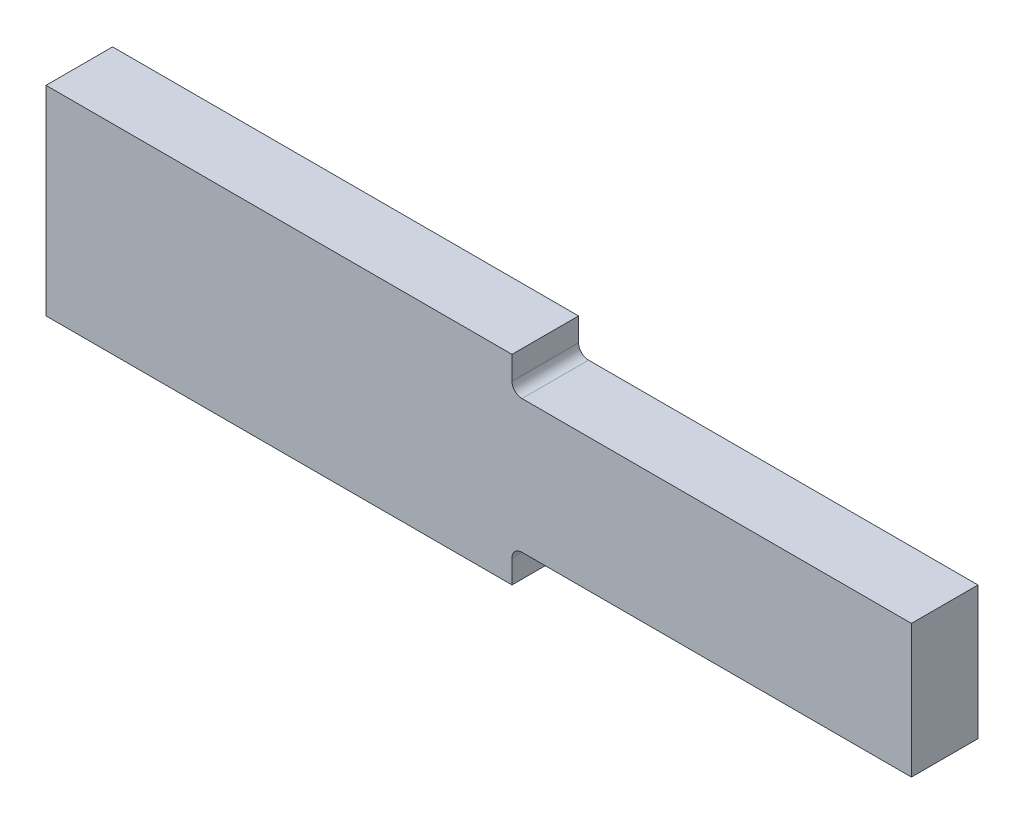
ISO-10303-21;
HEADER;
FILE_DESCRIPTION(('STEP AP214'),'2;1');
FILE_NAME('part.step','',(''),(''),'','','');
FILE_SCHEMA(('AUTOMOTIVE_DESIGN { 1 0 10303 214 1 1 1 1 }'));
ENDSEC;
DATA;
#1=APPLICATION_CONTEXT('core data for automotive mechanical design processes');
#2=APPLICATION_PROTOCOL_DEFINITION('international standard','automotive_design',2000,#1);
#3=PRODUCT_CONTEXT('',#1,'mechanical');
#4=PRODUCT('Part','Part','',(#3));
#5=PRODUCT_RELATED_PRODUCT_CATEGORY('part','',(#4));
#6=PRODUCT_DEFINITION_FORMATION('','',#4);
#7=PRODUCT_DEFINITION_CONTEXT('part definition',#1,'design');
#8=PRODUCT_DEFINITION('design','',#6,#7);
#9=PRODUCT_DEFINITION_SHAPE('','',#8);
#10=(LENGTH_UNIT() NAMED_UNIT(*) SI_UNIT(.MILLI.,.METRE.));
#11=(NAMED_UNIT(*) PLANE_ANGLE_UNIT() SI_UNIT($,.RADIAN.));
#12=(NAMED_UNIT(*) SI_UNIT($,.STERADIAN.) SOLID_ANGLE_UNIT());
#13=UNCERTAINTY_MEASURE_WITH_UNIT(LENGTH_MEASURE(1.E-05),#10,'distance_accuracy_value','');
#14=(GEOMETRIC_REPRESENTATION_CONTEXT(3) GLOBAL_UNCERTAINTY_ASSIGNED_CONTEXT((#13)) GLOBAL_UNIT_ASSIGNED_CONTEXT((#10,
#11,#12)) REPRESENTATION_CONTEXT('',''));
#15=CARTESIAN_POINT('',(0.,0.,0.));
#16=DIRECTION('',(0.,0.,1.));
#17=DIRECTION('',(1.,0.,0.));
#18=AXIS2_PLACEMENT_3D('',#15,#16,#17);
#19=CARTESIAN_POINT('',(140.,-30.,20.));
#20=DIRECTION('',(0.,1.,0.));
#21=DIRECTION('',(0.,0.,1.));
#22=AXIS2_PLACEMENT_3D('',#19,#20,#21);
#23=PLANE('',#22);
#24=DIRECTION('',(1.,0.,0.));
#25=VECTOR('',#24,1.);
#26=CARTESIAN_POINT('',(140.,-30.,0.));
#27=LINE('',#26,#25);
#28=CARTESIAN_POINT('',(0.,-30.,0.));
#29=VERTEX_POINT('',#28);
#30=CARTESIAN_POINT('',(140.,-30.,0.));
#31=VERTEX_POINT('',#30);
#32=EDGE_CURVE('E133',#29,#31,#27,.T.);
#33=ORIENTED_EDGE('',*,*,#32,.T.);
#34=DIRECTION('',(0.,0.,-1.));
#35=VECTOR('',#34,1.);
#36=CARTESIAN_POINT('',(140.,-30.,20.));
#37=LINE('',#36,#35);
#38=CARTESIAN_POINT('',(140.,-30.,20.));
#39=VERTEX_POINT('',#38);
#40=EDGE_CURVE('E114',#39,#31,#37,.T.);
#41=ORIENTED_EDGE('',*,*,#40,.F.);
#42=DIRECTION('',(1.,0.,0.));
#43=VECTOR('',#42,1.);
#44=CARTESIAN_POINT('',(140.,-30.,20.));
#45=LINE('',#44,#43);
#46=CARTESIAN_POINT('',(0.,-30.,20.));
#47=VERTEX_POINT('',#46);
#48=EDGE_CURVE('E121',#47,#39,#45,.T.);
#49=ORIENTED_EDGE('',*,*,#48,.F.);
#50=DIRECTION('',(0.,0.,-1.));
#51=VECTOR('',#50,1.);
#52=CARTESIAN_POINT('',(0.,-30.,20.));
#53=LINE('',#52,#51);
#54=EDGE_CURVE('E181',#47,#29,#53,.T.);
#55=ORIENTED_EDGE('',*,*,#54,.T.);
#56=EDGE_LOOP('',(#33,#41,#49,#55));
#57=FACE_BOUND('',#56,.T.);
#58=ADVANCED_FACE('F32',(#57),#23,.F.);
#59=CARTESIAN_POINT('',(140.,-20.,20.));
#60=DIRECTION('',(-1.,0.,0.));
#61=DIRECTION('',(0.,0.,1.));
#62=AXIS2_PLACEMENT_3D('',#59,#60,#61);
#63=PLANE('',#62);
#64=DIRECTION('',(0.,1.,0.));
#65=VECTOR('',#64,1.);
#66=CARTESIAN_POINT('',(140.,-20.,0.));
#67=LINE('',#66,#65);
#68=CARTESIAN_POINT('',(140.,-23.,0.));
#69=VERTEX_POINT('',#68);
#70=EDGE_CURVE('E164',#31,#69,#67,.T.);
#71=ORIENTED_EDGE('',*,*,#70,.T.);
#72=DIRECTION('',(0.,0.,-1.));
#73=VECTOR('',#72,1.);
#74=CARTESIAN_POINT('',(140.,-23.,20.));
#75=LINE('',#74,#73);
#76=CARTESIAN_POINT('',(140.,-23.,20.));
#77=VERTEX_POINT('',#76);
#78=EDGE_CURVE('E117',#69,#77,#75,.F.);
#79=ORIENTED_EDGE('',*,*,#78,.T.);
#80=DIRECTION('',(0.,1.,0.));
#81=VECTOR('',#80,1.);
#82=CARTESIAN_POINT('',(140.,-20.,20.));
#83=LINE('',#82,#81);
#84=EDGE_CURVE('E109',#39,#77,#83,.T.);
#85=ORIENTED_EDGE('',*,*,#84,.F.);
#86=ORIENTED_EDGE('',*,*,#40,.T.);
#87=EDGE_LOOP('',(#71,#79,#85,#86));
#88=FACE_BOUND('',#87,.T.);
#89=ADVANCED_FACE('F112',(#88),#63,.F.);
#90=CARTESIAN_POINT('',(260.,-20.,20.));
#91=DIRECTION('',(0.,1.,0.));
#92=DIRECTION('',(-1.,0.,0.));
#93=AXIS2_PLACEMENT_3D('',#90,#91,#92);
#94=PLANE('',#93);
#95=DIRECTION('',(1.,0.,0.));
#96=VECTOR('',#95,1.);
#97=CARTESIAN_POINT('',(260.,-20.,20.));
#98=LINE('',#97,#96);
#99=CARTESIAN_POINT('',(143.,-20.,20.));
#100=VERTEX_POINT('',#99);
#101=CARTESIAN_POINT('',(260.,-20.,20.));
#102=VERTEX_POINT('',#101);
#103=EDGE_CURVE('E120',#100,#102,#98,.T.);
#104=ORIENTED_EDGE('',*,*,#103,.F.);
#105=DIRECTION('',(0.,0.,-1.));
#106=VECTOR('',#105,1.);
#107=CARTESIAN_POINT('',(143.,-20.,0.));
#108=LINE('',#107,#106);
#109=CARTESIAN_POINT('',(143.,-20.,0.));
#110=VERTEX_POINT('',#109);
#111=EDGE_CURVE('E134',#100,#110,#108,.T.);
#112=ORIENTED_EDGE('',*,*,#111,.T.);
#113=DIRECTION('',(1.,0.,0.));
#114=VECTOR('',#113,1.);
#115=CARTESIAN_POINT('',(260.,-20.,0.));
#116=LINE('',#115,#114);
#117=CARTESIAN_POINT('',(260.,-20.,0.));
#118=VERTEX_POINT('',#117);
#119=EDGE_CURVE('E166',#110,#118,#116,.T.);
#120=ORIENTED_EDGE('',*,*,#119,.T.);
#121=DIRECTION('',(0.,0.,-1.));
#122=VECTOR('',#121,1.);
#123=CARTESIAN_POINT('',(260.,-20.,20.));
#124=LINE('',#123,#122);
#125=EDGE_CURVE('E135',#102,#118,#124,.T.);
#126=ORIENTED_EDGE('',*,*,#125,.F.);
#127=EDGE_LOOP('',(#104,#112,#120,#126));
#128=FACE_BOUND('',#127,.T.);
#129=ADVANCED_FACE('F157',(#128),#94,.F.);
#130=CARTESIAN_POINT('',(260.,20.,20.));
#131=DIRECTION('',(-1.,0.,0.));
#132=DIRECTION('',(0.,0.,1.));
#133=AXIS2_PLACEMENT_3D('',#130,#131,#132);
#134=PLANE('',#133);
#135=DIRECTION('',(0.,1.,0.));
#136=VECTOR('',#135,1.);
#137=CARTESIAN_POINT('',(260.,20.,0.));
#138=LINE('',#137,#136);
#139=CARTESIAN_POINT('',(260.,20.,0.));
#140=VERTEX_POINT('',#139);
#141=EDGE_CURVE('E168',#118,#140,#138,.T.);
#142=ORIENTED_EDGE('',*,*,#141,.T.);
#143=DIRECTION('',(0.,0.,-1.));
#144=VECTOR('',#143,1.);
#145=CARTESIAN_POINT('',(260.,20.,20.));
#146=LINE('',#145,#144);
#147=CARTESIAN_POINT('',(260.,20.,20.));
#148=VERTEX_POINT('',#147);
#149=EDGE_CURVE('E140',#148,#140,#146,.T.);
#150=ORIENTED_EDGE('',*,*,#149,.F.);
#151=DIRECTION('',(0.,1.,0.));
#152=VECTOR('',#151,1.);
#153=CARTESIAN_POINT('',(260.,20.,20.));
#154=LINE('',#153,#152);
#155=EDGE_CURVE('E160',#102,#148,#154,.T.);
#156=ORIENTED_EDGE('',*,*,#155,.F.);
#157=ORIENTED_EDGE('',*,*,#125,.T.);
#158=EDGE_LOOP('',(#142,#150,#156,#157));
#159=FACE_BOUND('',#158,.T.);
#160=ADVANCED_FACE('F193',(#159),#134,.F.);
#161=CARTESIAN_POINT('',(140.,20.,20.));
#162=DIRECTION('',(0.,-1.,0.));
#163=DIRECTION('',(1.,0.,0.));
#164=AXIS2_PLACEMENT_3D('',#161,#162,#163);
#165=PLANE('',#164);
#166=DIRECTION('',(-1.,0.,0.));
#167=VECTOR('',#166,1.);
#168=CARTESIAN_POINT('',(140.,20.,0.));
#169=LINE('',#168,#167);
#170=CARTESIAN_POINT('',(143.,20.,0.));
#171=VERTEX_POINT('',#170);
#172=EDGE_CURVE('E174',#140,#171,#169,.T.);
#173=ORIENTED_EDGE('',*,*,#172,.T.);
#174=DIRECTION('',(0.,0.,-1.));
#175=VECTOR('',#174,1.);
#176=CARTESIAN_POINT('',(143.,20.,20.));
#177=LINE('',#176,#175);
#178=CARTESIAN_POINT('',(143.,20.,20.));
#179=VERTEX_POINT('',#178);
#180=EDGE_CURVE('E47',#171,#179,#177,.F.);
#181=ORIENTED_EDGE('',*,*,#180,.T.);
#182=DIRECTION('',(-1.,0.,0.));
#183=VECTOR('',#182,1.);
#184=CARTESIAN_POINT('',(140.,20.,20.));
#185=LINE('',#184,#183);
#186=EDGE_CURVE('E191',#148,#179,#185,.T.);
#187=ORIENTED_EDGE('',*,*,#186,.F.);
#188=ORIENTED_EDGE('',*,*,#149,.T.);
#189=EDGE_LOOP('',(#173,#181,#187,#188));
#190=FACE_BOUND('',#189,.T.);
#191=ADVANCED_FACE('F190',(#190),#165,.F.);
#192=CARTESIAN_POINT('',(140.,30.,20.));
#193=DIRECTION('',(-1.,0.,0.));
#194=DIRECTION('',(0.,0.,1.));
#195=AXIS2_PLACEMENT_3D('',#192,#193,#194);
#196=PLANE('',#195);
#197=DIRECTION('',(0.,1.,0.));
#198=VECTOR('',#197,1.);
#199=CARTESIAN_POINT('',(140.,30.,20.));
#200=LINE('',#199,#198);
#201=CARTESIAN_POINT('',(140.,23.,20.));
#202=VERTEX_POINT('',#201);
#203=CARTESIAN_POINT('',(140.,30.,20.));
#204=VERTEX_POINT('',#203);
#205=EDGE_CURVE('E195',#202,#204,#200,.T.);
#206=ORIENTED_EDGE('',*,*,#205,.F.);
#207=DIRECTION('',(0.,0.,-1.));
#208=VECTOR('',#207,1.);
#209=CARTESIAN_POINT('',(140.,23.,0.));
#210=LINE('',#209,#208);
#211=CARTESIAN_POINT('',(140.,23.,0.));
#212=VERTEX_POINT('',#211);
#213=EDGE_CURVE('E145',#202,#212,#210,.T.);
#214=ORIENTED_EDGE('',*,*,#213,.T.);
#215=DIRECTION('',(0.,1.,0.));
#216=VECTOR('',#215,1.);
#217=CARTESIAN_POINT('',(140.,30.,0.));
#218=LINE('',#217,#216);
#219=CARTESIAN_POINT('',(140.,30.,0.));
#220=VERTEX_POINT('',#219);
#221=EDGE_CURVE('E176',#212,#220,#218,.T.);
#222=ORIENTED_EDGE('',*,*,#221,.T.);
#223=DIRECTION('',(0.,0.,-1.));
#224=VECTOR('',#223,1.);
#225=CARTESIAN_POINT('',(140.,30.,20.));
#226=LINE('',#225,#224);
#227=EDGE_CURVE('E186',#204,#220,#226,.T.);
#228=ORIENTED_EDGE('',*,*,#227,.F.);
#229=EDGE_LOOP('',(#206,#214,#222,#228));
#230=FACE_BOUND('',#229,.T.);
#231=ADVANCED_FACE('F211',(#230),#196,.F.);
#232=CARTESIAN_POINT('',(0.,30.,20.));
#233=DIRECTION('',(0.,-1.,0.));
#234=DIRECTION('',(0.,0.,-1.));
#235=AXIS2_PLACEMENT_3D('',#232,#233,#234);
#236=PLANE('',#235);
#237=DIRECTION('',(-1.,0.,0.));
#238=VECTOR('',#237,1.);
#239=CARTESIAN_POINT('',(0.,30.,0.));
#240=LINE('',#239,#238);
#241=CARTESIAN_POINT('',(0.,30.,0.));
#242=VERTEX_POINT('',#241);
#243=EDGE_CURVE('E178',#220,#242,#240,.T.);
#244=ORIENTED_EDGE('',*,*,#243,.T.);
#245=DIRECTION('',(0.,0.,-1.));
#246=VECTOR('',#245,1.);
#247=CARTESIAN_POINT('',(0.,30.,20.));
#248=LINE('',#247,#246);
#249=CARTESIAN_POINT('',(0.,30.,20.));
#250=VERTEX_POINT('',#249);
#251=EDGE_CURVE('E183',#250,#242,#248,.T.);
#252=ORIENTED_EDGE('',*,*,#251,.F.);
#253=DIRECTION('',(-1.,0.,0.));
#254=VECTOR('',#253,1.);
#255=CARTESIAN_POINT('',(0.,30.,20.));
#256=LINE('',#255,#254);
#257=EDGE_CURVE('E199',#204,#250,#256,.T.);
#258=ORIENTED_EDGE('',*,*,#257,.F.);
#259=ORIENTED_EDGE('',*,*,#227,.T.);
#260=EDGE_LOOP('',(#244,#252,#258,#259));
#261=FACE_BOUND('',#260,.T.);
#262=ADVANCED_FACE('F205',(#261),#236,.F.);
#263=CARTESIAN_POINT('',(0.,-30.,20.));
#264=DIRECTION('',(1.,0.,0.));
#265=DIRECTION('',(0.,0.,-1.));
#266=AXIS2_PLACEMENT_3D('',#263,#264,#265);
#267=PLANE('',#266);
#268=DIRECTION('',(0.,-1.,0.));
#269=VECTOR('',#268,1.);
#270=CARTESIAN_POINT('',(0.,-30.,0.));
#271=LINE('',#270,#269);
#272=EDGE_CURVE('E130',#242,#29,#271,.T.);
#273=ORIENTED_EDGE('',*,*,#272,.T.);
#274=ORIENTED_EDGE('',*,*,#54,.F.);
#275=DIRECTION('',(0.,-1.,0.));
#276=VECTOR('',#275,1.);
#277=CARTESIAN_POINT('',(0.,-30.,20.));
#278=LINE('',#277,#276);
#279=EDGE_CURVE('E126',#250,#47,#278,.T.);
#280=ORIENTED_EDGE('',*,*,#279,.F.);
#281=ORIENTED_EDGE('',*,*,#251,.T.);
#282=EDGE_LOOP('',(#273,#274,#280,#281));
#283=FACE_BOUND('',#282,.T.);
#284=ADVANCED_FACE('F209',(#283),#267,.F.);
#285=CARTESIAN_POINT('',(0.,0.,20.));
#286=DIRECTION('',(0.,0.,-1.));
#287=DIRECTION('',(-1.,0.,0.));
#288=AXIS2_PLACEMENT_3D('',#285,#286,#287);
#289=PLANE('',#288);
#290=ORIENTED_EDGE('',*,*,#48,.T.);
#291=ORIENTED_EDGE('',*,*,#84,.T.);
#292=CARTESIAN_POINT('',(143.,-23.,20.));
#293=DIRECTION('',(0.,0.,-1.));
#294=DIRECTION('',(-1.,0.,0.));
#295=AXIS2_PLACEMENT_3D('',#292,#293,#294);
#296=CIRCLE('',#295,3.);
#297=EDGE_CURVE('E151',#77,#100,#296,.T.);
#298=ORIENTED_EDGE('',*,*,#297,.T.);
#299=ORIENTED_EDGE('',*,*,#103,.T.);
#300=ORIENTED_EDGE('',*,*,#155,.T.);
#301=ORIENTED_EDGE('',*,*,#186,.T.);
#302=CARTESIAN_POINT('',(143.,23.,20.));
#303=DIRECTION('',(0.,0.,-1.));
#304=DIRECTION('',(-1.,0.,0.));
#305=AXIS2_PLACEMENT_3D('',#302,#303,#304);
#306=CIRCLE('',#305,3.);
#307=EDGE_CURVE('E11',#179,#202,#306,.T.);
#308=ORIENTED_EDGE('',*,*,#307,.T.);
#309=ORIENTED_EDGE('',*,*,#205,.T.);
#310=ORIENTED_EDGE('',*,*,#257,.T.);
#311=ORIENTED_EDGE('',*,*,#279,.T.);
#312=EDGE_LOOP('',(#290,#291,#298,#299,#300,#301,#308,#309,#310,#311));
#313=FACE_BOUND('',#312,.T.);
#314=ADVANCED_FACE('F124',(#313),#289,.F.);
#315=CARTESIAN_POINT('',(0.,0.,0.));
#316=DIRECTION('',(0.,0.,-1.));
#317=DIRECTION('',(-1.,0.,0.));
#318=AXIS2_PLACEMENT_3D('',#315,#316,#317);
#319=PLANE('',#318);
#320=ORIENTED_EDGE('',*,*,#32,.F.);
#321=ORIENTED_EDGE('',*,*,#272,.F.);
#322=ORIENTED_EDGE('',*,*,#243,.F.);
#323=ORIENTED_EDGE('',*,*,#221,.F.);
#324=CARTESIAN_POINT('',(143.,23.,0.));
#325=DIRECTION('',(0.,0.,-1.));
#326=DIRECTION('',(-1.,0.,0.));
#327=AXIS2_PLACEMENT_3D('',#324,#325,#326);
#328=CIRCLE('',#327,3.);
#329=EDGE_CURVE('E40',#212,#171,#328,.F.);
#330=ORIENTED_EDGE('',*,*,#329,.T.);
#331=ORIENTED_EDGE('',*,*,#172,.F.);
#332=ORIENTED_EDGE('',*,*,#141,.F.);
#333=ORIENTED_EDGE('',*,*,#119,.F.);
#334=CARTESIAN_POINT('',(143.,-23.,0.));
#335=DIRECTION('',(0.,0.,-1.));
#336=DIRECTION('',(-1.,0.,0.));
#337=AXIS2_PLACEMENT_3D('',#334,#335,#336);
#338=CIRCLE('',#337,3.);
#339=EDGE_CURVE('E149',#110,#69,#338,.F.);
#340=ORIENTED_EDGE('',*,*,#339,.T.);
#341=ORIENTED_EDGE('',*,*,#70,.F.);
#342=EDGE_LOOP('',(#320,#321,#322,#323,#330,#331,#332,#333,#340,#341));
#343=FACE_BOUND('',#342,.T.);
#344=ADVANCED_FACE('F163',(#343),#319,.T.);
#345=CARTESIAN_POINT('',(143.,-23.,20.));
#346=DIRECTION('',(0.,0.,1.));
#347=DIRECTION('',(1.,0.,0.));
#348=AXIS2_PLACEMENT_3D('',#345,#346,#347);
#349=CYLINDRICAL_SURFACE('',#348,3.);
#350=ORIENTED_EDGE('',*,*,#297,.F.);
#351=ORIENTED_EDGE('',*,*,#78,.F.);
#352=ORIENTED_EDGE('',*,*,#339,.F.);
#353=ORIENTED_EDGE('',*,*,#111,.F.);
#354=EDGE_LOOP('',(#350,#351,#352,#353));
#355=FACE_BOUND('',#354,.T.);
#356=ADVANCED_FACE('F162',(#355),#349,.F.);
#357=CARTESIAN_POINT('',(143.,23.,20.));
#358=DIRECTION('',(0.,0.,1.));
#359=DIRECTION('',(1.,0.,0.));
#360=AXIS2_PLACEMENT_3D('',#357,#358,#359);
#361=CYLINDRICAL_SURFACE('',#360,3.);
#362=ORIENTED_EDGE('',*,*,#307,.F.);
#363=ORIENTED_EDGE('',*,*,#180,.F.);
#364=ORIENTED_EDGE('',*,*,#329,.F.);
#365=ORIENTED_EDGE('',*,*,#213,.F.);
#366=EDGE_LOOP('',(#362,#363,#364,#365));
#367=FACE_BOUND('',#366,.T.);
#368=ADVANCED_FACE('F34',(#367),#361,.F.);
#369=CLOSED_SHELL('',(#58,#89,#129,#160,#191,#231,#262,#284,#314,#344,#356,#368));
#370=MANIFOLD_SOLID_BREP('B2',#369);
#371=ADVANCED_BREP_SHAPE_REPRESENTATION('',(#18,#370),#14);
#372=SHAPE_DEFINITION_REPRESENTATION(#9,#371);
ENDSEC;
END-ISO-10303-21;
